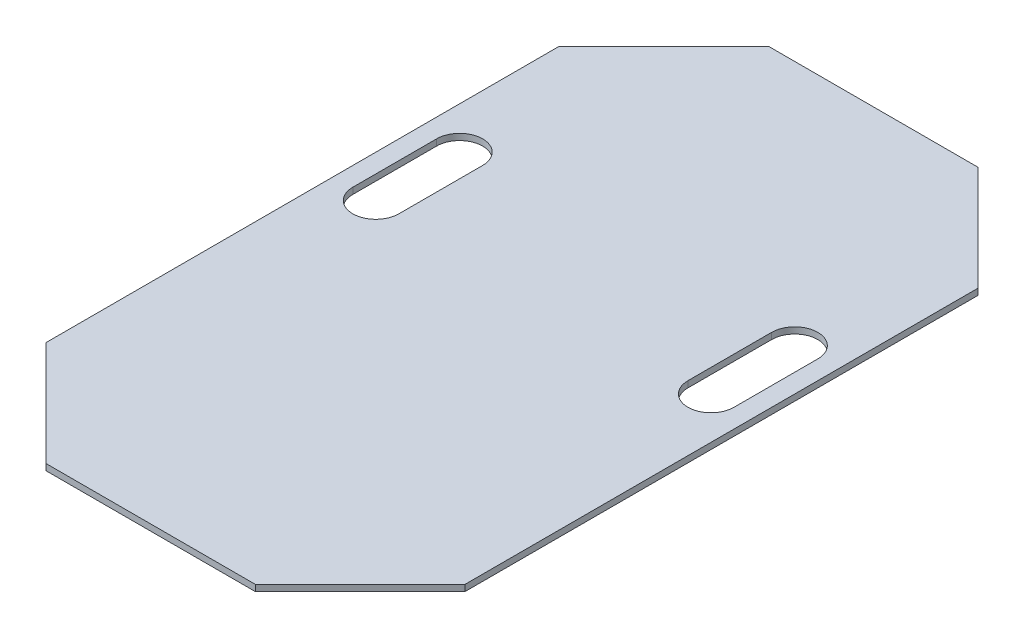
ISO-10303-21;
HEADER;
FILE_DESCRIPTION(('STEP AP214'),'2;1');
FILE_NAME('part.step','',(''),(''),'','','');
FILE_SCHEMA(('AUTOMOTIVE_DESIGN { 1 0 10303 214 1 1 1 1 }'));
ENDSEC;
DATA;
#1=APPLICATION_CONTEXT('core data for automotive mechanical design processes');
#2=APPLICATION_PROTOCOL_DEFINITION('international standard','automotive_design',2000,#1);
#3=PRODUCT_CONTEXT('',#1,'mechanical');
#4=PRODUCT('Part','Part','',(#3));
#5=PRODUCT_RELATED_PRODUCT_CATEGORY('part','',(#4));
#6=PRODUCT_DEFINITION_FORMATION('','',#4);
#7=PRODUCT_DEFINITION_CONTEXT('part definition',#1,'design');
#8=PRODUCT_DEFINITION('design','',#6,#7);
#9=PRODUCT_DEFINITION_SHAPE('','',#8);
#10=(LENGTH_UNIT() NAMED_UNIT(*) SI_UNIT(.MILLI.,.METRE.));
#11=(NAMED_UNIT(*) PLANE_ANGLE_UNIT() SI_UNIT($,.RADIAN.));
#12=(NAMED_UNIT(*) SI_UNIT($,.STERADIAN.) SOLID_ANGLE_UNIT());
#13=UNCERTAINTY_MEASURE_WITH_UNIT(LENGTH_MEASURE(1.E-05),#10,'distance_accuracy_value','');
#14=(GEOMETRIC_REPRESENTATION_CONTEXT(3) GLOBAL_UNCERTAINTY_ASSIGNED_CONTEXT((#13)) GLOBAL_UNIT_ASSIGNED_CONTEXT((#10,
#11,#12)) REPRESENTATION_CONTEXT('',''));
#15=CARTESIAN_POINT('',(0.,0.,0.));
#16=DIRECTION('',(0.,0.,1.));
#17=DIRECTION('',(1.,0.,0.));
#18=AXIS2_PLACEMENT_3D('',#15,#16,#17);
#19=CARTESIAN_POINT('',(10.,0.299999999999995,1.37731543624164));
#20=DIRECTION('',(-1.,0.,0.));
#21=DIRECTION('',(0.,0.,1.));
#22=AXIS2_PLACEMENT_3D('',#19,#20,#21);
#23=PLANE('',#22);
#24=DIRECTION('',(0.,0.,-1.));
#25=VECTOR('',#24,1.);
#26=CARTESIAN_POINT('',(10.,0.,1.37731543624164));
#27=LINE('',#26,#25);
#28=CARTESIAN_POINT('',(10.,0.,25.8773154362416));
#29=VERTEX_POINT('',#28);
#30=CARTESIAN_POINT('',(10.,0.,1.37731543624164));
#31=VERTEX_POINT('',#30);
#32=EDGE_CURVE('E196',#29,#31,#27,.T.);
#33=ORIENTED_EDGE('',*,*,#32,.T.);
#34=DIRECTION('',(0.,-1.,0.));
#35=VECTOR('',#34,1.);
#36=CARTESIAN_POINT('',(10.,0.299999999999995,1.37731543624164));
#37=LINE('',#36,#35);
#38=CARTESIAN_POINT('',(10.,0.299999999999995,1.37731543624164));
#39=VERTEX_POINT('',#38);
#40=EDGE_CURVE('E11',#39,#31,#37,.T.);
#41=ORIENTED_EDGE('',*,*,#40,.F.);
#42=DIRECTION('',(0.,0.,-1.));
#43=VECTOR('',#42,1.);
#44=CARTESIAN_POINT('',(10.,0.299999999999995,1.37731543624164));
#45=LINE('',#44,#43);
#46=CARTESIAN_POINT('',(10.,0.299999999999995,25.8773154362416));
#47=VERTEX_POINT('',#46);
#48=EDGE_CURVE('E219',#47,#39,#45,.T.);
#49=ORIENTED_EDGE('',*,*,#48,.F.);
#50=DIRECTION('',(0.,-1.,0.));
#51=VECTOR('',#50,1.);
#52=CARTESIAN_POINT('',(10.,0.299999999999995,25.8773154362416));
#53=LINE('',#52,#51);
#54=EDGE_CURVE('E236',#47,#29,#53,.T.);
#55=ORIENTED_EDGE('',*,*,#54,.T.);
#56=EDGE_LOOP('',(#33,#41,#49,#55));
#57=FACE_BOUND('',#56,.T.);
#58=ADVANCED_FACE('F22',(#57),#23,.F.);
#59=CARTESIAN_POINT('',(5.00000000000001,0.299999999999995,-3.62268456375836));
#60=DIRECTION('',(-0.707106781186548,0.,0.707106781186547));
#61=DIRECTION('',(0.707106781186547,0.,0.707106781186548));
#62=AXIS2_PLACEMENT_3D('',#59,#60,#61);
#63=PLANE('',#62);
#64=DIRECTION('',(-0.707106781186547,0.,-0.707106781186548));
#65=VECTOR('',#64,1.);
#66=CARTESIAN_POINT('',(5.00000000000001,0.,-3.62268456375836));
#67=LINE('',#66,#65);
#68=CARTESIAN_POINT('',(5.00000000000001,0.,-3.62268456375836));
#69=VERTEX_POINT('',#68);
#70=EDGE_CURVE('E205',#31,#69,#67,.T.);
#71=ORIENTED_EDGE('',*,*,#70,.T.);
#72=DIRECTION('',(0.,-1.,0.));
#73=VECTOR('',#72,1.);
#74=CARTESIAN_POINT('',(5.00000000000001,0.299999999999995,-3.62268456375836));
#75=LINE('',#74,#73);
#76=CARTESIAN_POINT('',(5.00000000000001,0.299999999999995,-3.62268456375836));
#77=VERTEX_POINT('',#76);
#78=EDGE_CURVE('E29',#77,#69,#75,.T.);
#79=ORIENTED_EDGE('',*,*,#78,.F.);
#80=DIRECTION('',(-0.707106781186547,0.,-0.707106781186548));
#81=VECTOR('',#80,1.);
#82=CARTESIAN_POINT('',(5.00000000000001,0.299999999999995,-3.62268456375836));
#83=LINE('',#82,#81);
#84=EDGE_CURVE('E222',#39,#77,#83,.T.);
#85=ORIENTED_EDGE('',*,*,#84,.F.);
#86=ORIENTED_EDGE('',*,*,#40,.T.);
#87=EDGE_LOOP('',(#71,#79,#85,#86));
#88=FACE_BOUND('',#87,.T.);
#89=ADVANCED_FACE('F280',(#88),#63,.F.);
#90=CARTESIAN_POINT('',(-4.99999999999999,0.299999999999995,-3.62268456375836));
#91=DIRECTION('',(0.,0.,1.));
#92=DIRECTION('',(1.,0.,0.));
#93=AXIS2_PLACEMENT_3D('',#90,#91,#92);
#94=PLANE('',#93);
#95=DIRECTION('',(-1.,0.,0.));
#96=VECTOR('',#95,1.);
#97=CARTESIAN_POINT('',(-4.99999999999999,0.,-3.62268456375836));
#98=LINE('',#97,#96);
#99=CARTESIAN_POINT('',(-4.99999999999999,0.,-3.62268456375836));
#100=VERTEX_POINT('',#99);
#101=EDGE_CURVE('E207',#69,#100,#98,.T.);
#102=ORIENTED_EDGE('',*,*,#101,.T.);
#103=DIRECTION('',(0.,-1.,0.));
#104=VECTOR('',#103,1.);
#105=CARTESIAN_POINT('',(-4.99999999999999,0.299999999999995,-3.62268456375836));
#106=LINE('',#105,#104);
#107=CARTESIAN_POINT('',(-4.99999999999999,0.299999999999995,-3.62268456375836));
#108=VERTEX_POINT('',#107);
#109=EDGE_CURVE('E251',#108,#100,#106,.T.);
#110=ORIENTED_EDGE('',*,*,#109,.F.);
#111=DIRECTION('',(-1.,0.,0.));
#112=VECTOR('',#111,1.);
#113=CARTESIAN_POINT('',(-4.99999999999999,0.299999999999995,-3.62268456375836));
#114=LINE('',#113,#112);
#115=EDGE_CURVE('E224',#77,#108,#114,.T.);
#116=ORIENTED_EDGE('',*,*,#115,.F.);
#117=ORIENTED_EDGE('',*,*,#78,.T.);
#118=EDGE_LOOP('',(#102,#110,#116,#117));
#119=FACE_BOUND('',#118,.T.);
#120=ADVANCED_FACE('F258',(#119),#94,.F.);
#121=CARTESIAN_POINT('',(-4.99999999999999,0.299999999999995,-3.62268456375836));
#122=DIRECTION('',(0.707106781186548,0.,0.707106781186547));
#123=DIRECTION('',(0.707106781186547,0.,-0.707106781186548));
#124=AXIS2_PLACEMENT_3D('',#121,#122,#123);
#125=PLANE('',#124);
#126=DIRECTION('',(-0.707106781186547,0.,0.707106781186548));
#127=VECTOR('',#126,1.);
#128=CARTESIAN_POINT('',(-4.99999999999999,0.,-3.62268456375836));
#129=LINE('',#128,#127);
#130=CARTESIAN_POINT('',(-9.99999999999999,0.,1.37731543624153));
#131=VERTEX_POINT('',#130);
#132=EDGE_CURVE('E209',#100,#131,#129,.T.);
#133=ORIENTED_EDGE('',*,*,#132,.T.);
#134=DIRECTION('',(0.,-1.,0.));
#135=VECTOR('',#134,1.);
#136=CARTESIAN_POINT('',(-9.99999999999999,0.299999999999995,1.37731543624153));
#137=LINE('',#136,#135);
#138=CARTESIAN_POINT('',(-9.99999999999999,0.299999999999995,1.37731543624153));
#139=VERTEX_POINT('',#138);
#140=EDGE_CURVE('E248',#139,#131,#137,.T.);
#141=ORIENTED_EDGE('',*,*,#140,.F.);
#142=DIRECTION('',(-0.707106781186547,0.,0.707106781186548));
#143=VECTOR('',#142,1.);
#144=CARTESIAN_POINT('',(-4.99999999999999,0.299999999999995,-3.62268456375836));
#145=LINE('',#144,#143);
#146=EDGE_CURVE('E226',#108,#139,#145,.T.);
#147=ORIENTED_EDGE('',*,*,#146,.F.);
#148=ORIENTED_EDGE('',*,*,#109,.T.);
#149=EDGE_LOOP('',(#133,#141,#147,#148));
#150=FACE_BOUND('',#149,.T.);
#151=ADVANCED_FACE('F269',(#150),#125,.F.);
#152=CARTESIAN_POINT('',(-9.99999999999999,0.299999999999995,1.37731543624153));
#153=DIRECTION('',(1.,0.,0.));
#154=DIRECTION('',(0.,0.,-1.));
#155=AXIS2_PLACEMENT_3D('',#152,#153,#154);
#156=PLANE('',#155);
#157=DIRECTION('',(0.,0.,1.));
#158=VECTOR('',#157,1.);
#159=CARTESIAN_POINT('',(-9.99999999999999,0.,1.37731543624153));
#160=LINE('',#159,#158);
#161=CARTESIAN_POINT('',(-9.99999999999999,0.,25.8773154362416));
#162=VERTEX_POINT('',#161);
#163=EDGE_CURVE('E211',#131,#162,#160,.T.);
#164=ORIENTED_EDGE('',*,*,#163,.T.);
#165=DIRECTION('',(0.,-1.,0.));
#166=VECTOR('',#165,1.);
#167=CARTESIAN_POINT('',(-9.99999999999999,0.299999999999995,25.8773154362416));
#168=LINE('',#167,#166);
#169=CARTESIAN_POINT('',(-9.99999999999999,0.299999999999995,25.8773154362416));
#170=VERTEX_POINT('',#169);
#171=EDGE_CURVE('E245',#170,#162,#168,.T.);
#172=ORIENTED_EDGE('',*,*,#171,.F.);
#173=DIRECTION('',(0.,0.,1.));
#174=VECTOR('',#173,1.);
#175=CARTESIAN_POINT('',(-9.99999999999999,0.299999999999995,1.37731543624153));
#176=LINE('',#175,#174);
#177=EDGE_CURVE('E228',#139,#170,#176,.T.);
#178=ORIENTED_EDGE('',*,*,#177,.F.);
#179=ORIENTED_EDGE('',*,*,#140,.T.);
#180=EDGE_LOOP('',(#164,#172,#178,#179));
#181=FACE_BOUND('',#180,.T.);
#182=ADVANCED_FACE('F273',(#181),#156,.F.);
#183=CARTESIAN_POINT('',(-9.99999999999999,0.299999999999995,25.8773154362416));
#184=DIRECTION('',(0.707106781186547,0.,-0.707106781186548));
#185=DIRECTION('',(-0.707106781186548,0.,-0.707106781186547));
#186=AXIS2_PLACEMENT_3D('',#183,#184,#185);
#187=PLANE('',#186);
#188=DIRECTION('',(0.707106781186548,0.,0.707106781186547));
#189=VECTOR('',#188,1.);
#190=CARTESIAN_POINT('',(-9.99999999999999,0.,25.8773154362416));
#191=LINE('',#190,#189);
#192=CARTESIAN_POINT('',(-4.99999999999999,0.,30.8773154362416));
#193=VERTEX_POINT('',#192);
#194=EDGE_CURVE('E213',#162,#193,#191,.T.);
#195=ORIENTED_EDGE('',*,*,#194,.T.);
#196=DIRECTION('',(0.,-1.,0.));
#197=VECTOR('',#196,1.);
#198=CARTESIAN_POINT('',(-4.99999999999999,0.299999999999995,30.8773154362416));
#199=LINE('',#198,#197);
#200=CARTESIAN_POINT('',(-4.99999999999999,0.299999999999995,30.8773154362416));
#201=VERTEX_POINT('',#200);
#202=EDGE_CURVE('E242',#201,#193,#199,.T.);
#203=ORIENTED_EDGE('',*,*,#202,.F.);
#204=DIRECTION('',(0.707106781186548,0.,0.707106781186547));
#205=VECTOR('',#204,1.);
#206=CARTESIAN_POINT('',(-9.99999999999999,0.299999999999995,25.8773154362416));
#207=LINE('',#206,#205);
#208=EDGE_CURVE('E230',#170,#201,#207,.T.);
#209=ORIENTED_EDGE('',*,*,#208,.F.);
#210=ORIENTED_EDGE('',*,*,#171,.T.);
#211=EDGE_LOOP('',(#195,#203,#209,#210));
#212=FACE_BOUND('',#211,.T.);
#213=ADVANCED_FACE('F293',(#212),#187,.F.);
#214=CARTESIAN_POINT('',(5.00000000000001,0.299999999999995,30.8773154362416));
#215=DIRECTION('',(0.,0.,-1.));
#216=DIRECTION('',(-1.,0.,0.));
#217=AXIS2_PLACEMENT_3D('',#214,#215,#216);
#218=PLANE('',#217);
#219=DIRECTION('',(1.,0.,0.));
#220=VECTOR('',#219,1.);
#221=CARTESIAN_POINT('',(5.00000000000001,0.,30.8773154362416));
#222=LINE('',#221,#220);
#223=CARTESIAN_POINT('',(5.00000000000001,0.,30.8773154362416));
#224=VERTEX_POINT('',#223);
#225=EDGE_CURVE('E215',#193,#224,#222,.T.);
#226=ORIENTED_EDGE('',*,*,#225,.T.);
#227=DIRECTION('',(0.,-1.,0.));
#228=VECTOR('',#227,1.);
#229=CARTESIAN_POINT('',(5.00000000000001,0.299999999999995,30.8773154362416));
#230=LINE('',#229,#228);
#231=CARTESIAN_POINT('',(5.00000000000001,0.299999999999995,30.8773154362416));
#232=VERTEX_POINT('',#231);
#233=EDGE_CURVE('E239',#232,#224,#230,.T.);
#234=ORIENTED_EDGE('',*,*,#233,.F.);
#235=DIRECTION('',(1.,0.,0.));
#236=VECTOR('',#235,1.);
#237=CARTESIAN_POINT('',(5.00000000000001,0.299999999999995,30.8773154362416));
#238=LINE('',#237,#236);
#239=EDGE_CURVE('E232',#201,#232,#238,.T.);
#240=ORIENTED_EDGE('',*,*,#239,.F.);
#241=ORIENTED_EDGE('',*,*,#202,.T.);
#242=EDGE_LOOP('',(#226,#234,#240,#241));
#243=FACE_BOUND('',#242,.T.);
#244=ADVANCED_FACE('F291',(#243),#218,.F.);
#245=CARTESIAN_POINT('',(10.,0.299999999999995,25.8773154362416));
#246=DIRECTION('',(-0.707106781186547,0.,-0.707106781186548));
#247=DIRECTION('',(-0.707106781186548,0.,0.707106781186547));
#248=AXIS2_PLACEMENT_3D('',#245,#246,#247);
#249=PLANE('',#248);
#250=DIRECTION('',(0.707106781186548,0.,-0.707106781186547));
#251=VECTOR('',#250,1.);
#252=CARTESIAN_POINT('',(10.,0.,25.8773154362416));
#253=LINE('',#252,#251);
#254=EDGE_CURVE('E217',#224,#29,#253,.T.);
#255=ORIENTED_EDGE('',*,*,#254,.T.);
#256=ORIENTED_EDGE('',*,*,#54,.F.);
#257=DIRECTION('',(0.707106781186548,0.,-0.707106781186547));
#258=VECTOR('',#257,1.);
#259=CARTESIAN_POINT('',(10.,0.299999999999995,25.8773154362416));
#260=LINE('',#259,#258);
#261=EDGE_CURVE('E234',#232,#47,#260,.T.);
#262=ORIENTED_EDGE('',*,*,#261,.F.);
#263=ORIENTED_EDGE('',*,*,#233,.T.);
#264=EDGE_LOOP('',(#255,#256,#262,#263));
#265=FACE_BOUND('',#264,.T.);
#266=ADVANCED_FACE('F286',(#265),#249,.F.);
#267=CARTESIAN_POINT('',(10.,0.299999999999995,-3.62268456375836));
#268=DIRECTION('',(0.,1.,0.));
#269=DIRECTION('',(0.,0.,1.));
#270=AXIS2_PLACEMENT_3D('',#267,#268,#269);
#271=PLANE('',#270);
#272=CARTESIAN_POINT('',(-7.99999999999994,0.299999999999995,8.12731543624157));
#273=DIRECTION('',(0.,1.,0.));
#274=DIRECTION('',(0.,0.,-1.));
#275=AXIS2_PLACEMENT_3D('',#272,#273,#274);
#276=CIRCLE('',#275,1.1);
#277=CARTESIAN_POINT('',(-6.89999999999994,0.299999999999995,8.12731543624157));
#278=VERTEX_POINT('',#277);
#279=CARTESIAN_POINT('',(-9.09999999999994,0.299999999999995,8.12731543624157));
#280=VERTEX_POINT('',#279);
#281=EDGE_CURVE('E36',#278,#280,#276,.T.);
#282=ORIENTED_EDGE('',*,*,#281,.F.);
#283=DIRECTION('',(0.,0.,-1.));
#284=VECTOR('',#283,1.);
#285=CARTESIAN_POINT('',(-6.89999999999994,0.299999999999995,8.12731543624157));
#286=LINE('',#285,#284);
#287=CARTESIAN_POINT('',(-6.9,0.299999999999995,12.1273154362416));
#288=VERTEX_POINT('',#287);
#289=EDGE_CURVE('E152',#288,#278,#286,.T.);
#290=ORIENTED_EDGE('',*,*,#289,.F.);
#291=CARTESIAN_POINT('',(-8.,0.299999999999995,12.1273154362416));
#292=DIRECTION('',(0.,1.,0.));
#293=DIRECTION('',(0.,0.,-1.));
#294=AXIS2_PLACEMENT_3D('',#291,#292,#293);
#295=CIRCLE('',#294,1.1);
#296=CARTESIAN_POINT('',(-9.1,0.299999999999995,12.1273154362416));
#297=VERTEX_POINT('',#296);
#298=EDGE_CURVE('E136',#297,#288,#295,.T.);
#299=ORIENTED_EDGE('',*,*,#298,.F.);
#300=DIRECTION('',(0.,0.,1.));
#301=VECTOR('',#300,1.);
#302=CARTESIAN_POINT('',(-9.09999999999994,0.299999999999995,8.12731543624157));
#303=LINE('',#302,#301);
#304=EDGE_CURVE('E145',#280,#297,#303,.T.);
#305=ORIENTED_EDGE('',*,*,#304,.F.);
#306=EDGE_LOOP('',(#282,#290,#299,#305));
#307=FACE_BOUND('',#306,.T.);
#308=CARTESIAN_POINT('',(8.,0.299999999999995,8.12731543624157));
#309=DIRECTION('',(0.,1.,0.));
#310=DIRECTION('',(0.,0.,1.));
#311=AXIS2_PLACEMENT_3D('',#308,#309,#310);
#312=CIRCLE('',#311,1.1);
#313=CARTESIAN_POINT('',(9.1,0.299999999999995,8.12731543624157));
#314=VERTEX_POINT('',#313);
#315=CARTESIAN_POINT('',(6.9,0.299999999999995,8.12731543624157));
#316=VERTEX_POINT('',#315);
#317=EDGE_CURVE('E168',#314,#316,#312,.T.);
#318=ORIENTED_EDGE('',*,*,#317,.F.);
#319=DIRECTION('',(0.,0.,-1.));
#320=VECTOR('',#319,1.);
#321=CARTESIAN_POINT('',(9.1,0.299999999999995,8.12731543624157));
#322=LINE('',#321,#320);
#323=CARTESIAN_POINT('',(9.1,0.299999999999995,12.1273154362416));
#324=VERTEX_POINT('',#323);
#325=EDGE_CURVE('E178',#324,#314,#322,.T.);
#326=ORIENTED_EDGE('',*,*,#325,.F.);
#327=CARTESIAN_POINT('',(8.,0.299999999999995,12.1273154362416));
#328=DIRECTION('',(0.,1.,0.));
#329=DIRECTION('',(0.,0.,1.));
#330=AXIS2_PLACEMENT_3D('',#327,#328,#329);
#331=CIRCLE('',#330,1.1);
#332=CARTESIAN_POINT('',(6.90000000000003,0.299999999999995,12.1273154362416));
#333=VERTEX_POINT('',#332);
#334=EDGE_CURVE('E175',#333,#324,#331,.T.);
#335=ORIENTED_EDGE('',*,*,#334,.F.);
#336=DIRECTION('',(0.,0.,1.));
#337=VECTOR('',#336,1.);
#338=CARTESIAN_POINT('',(6.9,0.299999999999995,8.12731543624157));
#339=LINE('',#338,#337);
#340=EDGE_CURVE('E172',#316,#333,#339,.T.);
#341=ORIENTED_EDGE('',*,*,#340,.F.);
#342=EDGE_LOOP('',(#318,#326,#335,#341));
#343=FACE_BOUND('',#342,.T.);
#344=ORIENTED_EDGE('',*,*,#48,.T.);
#345=ORIENTED_EDGE('',*,*,#84,.T.);
#346=ORIENTED_EDGE('',*,*,#115,.T.);
#347=ORIENTED_EDGE('',*,*,#146,.T.);
#348=ORIENTED_EDGE('',*,*,#177,.T.);
#349=ORIENTED_EDGE('',*,*,#208,.T.);
#350=ORIENTED_EDGE('',*,*,#239,.T.);
#351=ORIENTED_EDGE('',*,*,#261,.T.);
#352=EDGE_LOOP('',(#344,#345,#346,#347,#348,#349,#350,#351));
#353=FACE_BOUND('',#352,.T.);
#354=ADVANCED_FACE('F149',(#307,#343,#353),#271,.T.);
#355=CARTESIAN_POINT('',(10.,0.,-3.62268456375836));
#356=DIRECTION('',(0.,1.,0.));
#357=DIRECTION('',(0.,0.,1.));
#358=AXIS2_PLACEMENT_3D('',#355,#356,#357);
#359=PLANE('',#358);
#360=DIRECTION('',(0.,0.,-1.));
#361=VECTOR('',#360,1.);
#362=CARTESIAN_POINT('',(-6.89999999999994,0.,8.12731543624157));
#363=LINE('',#362,#361);
#364=CARTESIAN_POINT('',(-6.9,0.,12.1273154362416));
#365=VERTEX_POINT('',#364);
#366=CARTESIAN_POINT('',(-6.89999999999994,0.,8.12731543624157));
#367=VERTEX_POINT('',#366);
#368=EDGE_CURVE('E163',#365,#367,#363,.T.);
#369=ORIENTED_EDGE('',*,*,#368,.T.);
#370=CARTESIAN_POINT('',(-7.99999999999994,0.,8.12731543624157));
#371=DIRECTION('',(0.,1.,0.));
#372=DIRECTION('',(0.,0.,-1.));
#373=AXIS2_PLACEMENT_3D('',#370,#371,#372);
#374=CIRCLE('',#373,1.1);
#375=CARTESIAN_POINT('',(-9.09999999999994,0.,8.12731543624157));
#376=VERTEX_POINT('',#375);
#377=EDGE_CURVE('E154',#367,#376,#374,.T.);
#378=ORIENTED_EDGE('',*,*,#377,.T.);
#379=DIRECTION('',(0.,0.,1.));
#380=VECTOR('',#379,1.);
#381=CARTESIAN_POINT('',(-9.09999999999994,0.,8.12731543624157));
#382=LINE('',#381,#380);
#383=CARTESIAN_POINT('',(-9.1,0.,12.1273154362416));
#384=VERTEX_POINT('',#383);
#385=EDGE_CURVE('E160',#376,#384,#382,.T.);
#386=ORIENTED_EDGE('',*,*,#385,.T.);
#387=CARTESIAN_POINT('',(-8.,0.,12.1273154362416));
#388=DIRECTION('',(0.,1.,0.));
#389=DIRECTION('',(0.,0.,-1.));
#390=AXIS2_PLACEMENT_3D('',#387,#388,#389);
#391=CIRCLE('',#390,1.1);
#392=EDGE_CURVE('E44',#384,#365,#391,.T.);
#393=ORIENTED_EDGE('',*,*,#392,.T.);
#394=EDGE_LOOP('',(#369,#378,#386,#393));
#395=FACE_BOUND('',#394,.T.);
#396=DIRECTION('',(0.,0.,-1.));
#397=VECTOR('',#396,1.);
#398=CARTESIAN_POINT('',(9.1,0.,8.12731543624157));
#399=LINE('',#398,#397);
#400=CARTESIAN_POINT('',(9.1,0.,12.1273154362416));
#401=VERTEX_POINT('',#400);
#402=CARTESIAN_POINT('',(9.1,0.,8.12731543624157));
#403=VERTEX_POINT('',#402);
#404=EDGE_CURVE('E190',#401,#403,#399,.T.);
#405=ORIENTED_EDGE('',*,*,#404,.T.);
#406=CARTESIAN_POINT('',(8.,0.,8.12731543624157));
#407=DIRECTION('',(0.,1.,0.));
#408=DIRECTION('',(0.,0.,1.));
#409=AXIS2_PLACEMENT_3D('',#406,#407,#408);
#410=CIRCLE('',#409,1.1);
#411=CARTESIAN_POINT('',(6.9,0.,8.12731543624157));
#412=VERTEX_POINT('',#411);
#413=EDGE_CURVE('E181',#403,#412,#410,.T.);
#414=ORIENTED_EDGE('',*,*,#413,.T.);
#415=DIRECTION('',(0.,0.,1.));
#416=VECTOR('',#415,1.);
#417=CARTESIAN_POINT('',(6.9,0.,8.12731543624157));
#418=LINE('',#417,#416);
#419=CARTESIAN_POINT('',(6.90000000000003,0.,12.1273154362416));
#420=VERTEX_POINT('',#419);
#421=EDGE_CURVE('E184',#412,#420,#418,.T.);
#422=ORIENTED_EDGE('',*,*,#421,.T.);
#423=CARTESIAN_POINT('',(8.,0.,12.1273154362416));
#424=DIRECTION('',(0.,1.,0.));
#425=DIRECTION('',(0.,0.,1.));
#426=AXIS2_PLACEMENT_3D('',#423,#424,#425);
#427=CIRCLE('',#426,1.1);
#428=EDGE_CURVE('E187',#420,#401,#427,.T.);
#429=ORIENTED_EDGE('',*,*,#428,.T.);
#430=EDGE_LOOP('',(#405,#414,#422,#429));
#431=FACE_BOUND('',#430,.T.);
#432=ORIENTED_EDGE('',*,*,#32,.F.);
#433=ORIENTED_EDGE('',*,*,#254,.F.);
#434=ORIENTED_EDGE('',*,*,#225,.F.);
#435=ORIENTED_EDGE('',*,*,#194,.F.);
#436=ORIENTED_EDGE('',*,*,#163,.F.);
#437=ORIENTED_EDGE('',*,*,#132,.F.);
#438=ORIENTED_EDGE('',*,*,#101,.F.);
#439=ORIENTED_EDGE('',*,*,#70,.F.);
#440=EDGE_LOOP('',(#432,#433,#434,#435,#436,#437,#438,#439));
#441=FACE_BOUND('',#440,.T.);
#442=ADVANCED_FACE('F264',(#395,#431,#441),#359,.F.);
#443=CARTESIAN_POINT('',(8.,0.,8.12731543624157));
#444=DIRECTION('',(0.,1.,0.));
#445=DIRECTION('',(0.,0.,1.));
#446=AXIS2_PLACEMENT_3D('',#443,#444,#445);
#447=CYLINDRICAL_SURFACE('',#446,1.1);
#448=ORIENTED_EDGE('',*,*,#317,.T.);
#449=DIRECTION('',(0.,1.,0.));
#450=VECTOR('',#449,1.);
#451=CARTESIAN_POINT('',(6.9,0.,8.12731543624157));
#452=LINE('',#451,#450);
#453=EDGE_CURVE('E193',#412,#316,#452,.T.);
#454=ORIENTED_EDGE('',*,*,#453,.F.);
#455=ORIENTED_EDGE('',*,*,#413,.F.);
#456=DIRECTION('',(0.,1.,0.));
#457=VECTOR('',#456,1.);
#458=CARTESIAN_POINT('',(9.1,0.,8.12731543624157));
#459=LINE('',#458,#457);
#460=EDGE_CURVE('E194',#403,#314,#459,.T.);
#461=ORIENTED_EDGE('',*,*,#460,.T.);
#462=EDGE_LOOP('',(#448,#454,#455,#461));
#463=FACE_BOUND('',#462,.T.);
#464=ADVANCED_FACE('F325',(#463),#447,.F.);
#465=CARTESIAN_POINT('',(9.1,0.,8.12731543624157));
#466=DIRECTION('',(1.,0.,0.));
#467=DIRECTION('',(0.,0.,-1.));
#468=AXIS2_PLACEMENT_3D('',#465,#466,#467);
#469=PLANE('',#468);
#470=ORIENTED_EDGE('',*,*,#325,.T.);
#471=ORIENTED_EDGE('',*,*,#460,.F.);
#472=ORIENTED_EDGE('',*,*,#404,.F.);
#473=DIRECTION('',(0.,1.,0.));
#474=VECTOR('',#473,1.);
#475=CARTESIAN_POINT('',(9.1,0.,12.1273154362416));
#476=LINE('',#475,#474);
#477=EDGE_CURVE('E197',#401,#324,#476,.T.);
#478=ORIENTED_EDGE('',*,*,#477,.T.);
#479=EDGE_LOOP('',(#470,#471,#472,#478));
#480=FACE_BOUND('',#479,.T.);
#481=ADVANCED_FACE('F329',(#480),#469,.F.);
#482=CARTESIAN_POINT('',(8.,0.,12.1273154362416));
#483=DIRECTION('',(0.,1.,0.));
#484=DIRECTION('',(0.,0.,1.));
#485=AXIS2_PLACEMENT_3D('',#482,#483,#484);
#486=CYLINDRICAL_SURFACE('',#485,1.1);
#487=ORIENTED_EDGE('',*,*,#334,.T.);
#488=ORIENTED_EDGE('',*,*,#477,.F.);
#489=ORIENTED_EDGE('',*,*,#428,.F.);
#490=DIRECTION('',(0.,1.,0.));
#491=VECTOR('',#490,1.);
#492=CARTESIAN_POINT('',(6.90000000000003,0.,12.1273154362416));
#493=LINE('',#492,#491);
#494=EDGE_CURVE('E199',#420,#333,#493,.T.);
#495=ORIENTED_EDGE('',*,*,#494,.T.);
#496=EDGE_LOOP('',(#487,#488,#489,#495));
#497=FACE_BOUND('',#496,.T.);
#498=ADVANCED_FACE('F335',(#497),#486,.F.);
#499=CARTESIAN_POINT('',(6.9,0.,8.12731543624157));
#500=DIRECTION('',(-1.,0.,0.));
#501=DIRECTION('',(0.,0.,1.));
#502=AXIS2_PLACEMENT_3D('',#499,#500,#501);
#503=PLANE('',#502);
#504=ORIENTED_EDGE('',*,*,#340,.T.);
#505=ORIENTED_EDGE('',*,*,#494,.F.);
#506=ORIENTED_EDGE('',*,*,#421,.F.);
#507=ORIENTED_EDGE('',*,*,#453,.T.);
#508=EDGE_LOOP('',(#504,#505,#506,#507));
#509=FACE_BOUND('',#508,.T.);
#510=ADVANCED_FACE('F331',(#509),#503,.F.);
#511=CARTESIAN_POINT('',(-7.99999999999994,0.,8.12731543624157));
#512=DIRECTION('',(0.,1.,0.));
#513=DIRECTION('',(0.,0.,1.));
#514=AXIS2_PLACEMENT_3D('',#511,#512,#513);
#515=CYLINDRICAL_SURFACE('',#514,1.1);
#516=ORIENTED_EDGE('',*,*,#281,.T.);
#517=DIRECTION('',(0.,1.,0.));
#518=VECTOR('',#517,1.);
#519=CARTESIAN_POINT('',(-9.09999999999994,0.,8.12731543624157));
#520=LINE('',#519,#518);
#521=EDGE_CURVE('E142',#376,#280,#520,.T.);
#522=ORIENTED_EDGE('',*,*,#521,.F.);
#523=ORIENTED_EDGE('',*,*,#377,.F.);
#524=DIRECTION('',(0.,1.,0.));
#525=VECTOR('',#524,1.);
#526=CARTESIAN_POINT('',(-6.89999999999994,0.,8.12731543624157));
#527=LINE('',#526,#525);
#528=EDGE_CURVE('E166',#367,#278,#527,.T.);
#529=ORIENTED_EDGE('',*,*,#528,.T.);
#530=EDGE_LOOP('',(#516,#522,#523,#529));
#531=FACE_BOUND('',#530,.T.);
#532=ADVANCED_FACE('F334',(#531),#515,.F.);
#533=CARTESIAN_POINT('',(-6.89999999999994,0.,8.12731543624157));
#534=DIRECTION('',(1.,0.,0.));
#535=DIRECTION('',(0.,0.,-1.));
#536=AXIS2_PLACEMENT_3D('',#533,#534,#535);
#537=PLANE('',#536);
#538=ORIENTED_EDGE('',*,*,#289,.T.);
#539=ORIENTED_EDGE('',*,*,#528,.F.);
#540=ORIENTED_EDGE('',*,*,#368,.F.);
#541=DIRECTION('',(0.,1.,0.));
#542=VECTOR('',#541,1.);
#543=CARTESIAN_POINT('',(-6.9,0.,12.1273154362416));
#544=LINE('',#543,#542);
#545=EDGE_CURVE('E141',#365,#288,#544,.T.);
#546=ORIENTED_EDGE('',*,*,#545,.T.);
#547=EDGE_LOOP('',(#538,#539,#540,#546));
#548=FACE_BOUND('',#547,.T.);
#549=ADVANCED_FACE('F345',(#548),#537,.F.);
#550=CARTESIAN_POINT('',(-8.,0.,12.1273154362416));
#551=DIRECTION('',(0.,1.,0.));
#552=DIRECTION('',(0.,0.,1.));
#553=AXIS2_PLACEMENT_3D('',#550,#551,#552);
#554=CYLINDRICAL_SURFACE('',#553,1.1);
#555=ORIENTED_EDGE('',*,*,#298,.T.);
#556=ORIENTED_EDGE('',*,*,#545,.F.);
#557=ORIENTED_EDGE('',*,*,#392,.F.);
#558=DIRECTION('',(0.,1.,0.));
#559=VECTOR('',#558,1.);
#560=CARTESIAN_POINT('',(-9.1,0.,12.1273154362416));
#561=LINE('',#560,#559);
#562=EDGE_CURVE('E132',#384,#297,#561,.T.);
#563=ORIENTED_EDGE('',*,*,#562,.T.);
#564=EDGE_LOOP('',(#555,#556,#557,#563));
#565=FACE_BOUND('',#564,.T.);
#566=ADVANCED_FACE('F134',(#565),#554,.F.);
#567=CARTESIAN_POINT('',(-9.09999999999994,0.,8.12731543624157));
#568=DIRECTION('',(-1.,0.,0.));
#569=DIRECTION('',(0.,0.,1.));
#570=AXIS2_PLACEMENT_3D('',#567,#568,#569);
#571=PLANE('',#570);
#572=ORIENTED_EDGE('',*,*,#304,.T.);
#573=ORIENTED_EDGE('',*,*,#562,.F.);
#574=ORIENTED_EDGE('',*,*,#385,.F.);
#575=ORIENTED_EDGE('',*,*,#521,.T.);
#576=EDGE_LOOP('',(#572,#573,#574,#575));
#577=FACE_BOUND('',#576,.T.);
#578=ADVANCED_FACE('F146',(#577),#571,.F.);
#579=CLOSED_SHELL('',(#58,#89,#120,#151,#182,#213,#244,#266,#354,#442,#464,#481,#498,#510,#532,
#549,#566,#578));
#580=MANIFOLD_SOLID_BREP('B2',#579);
#581=ADVANCED_BREP_SHAPE_REPRESENTATION('',(#18,#580),#14);
#582=SHAPE_DEFINITION_REPRESENTATION(#9,#581);
ENDSEC;
END-ISO-10303-21;
